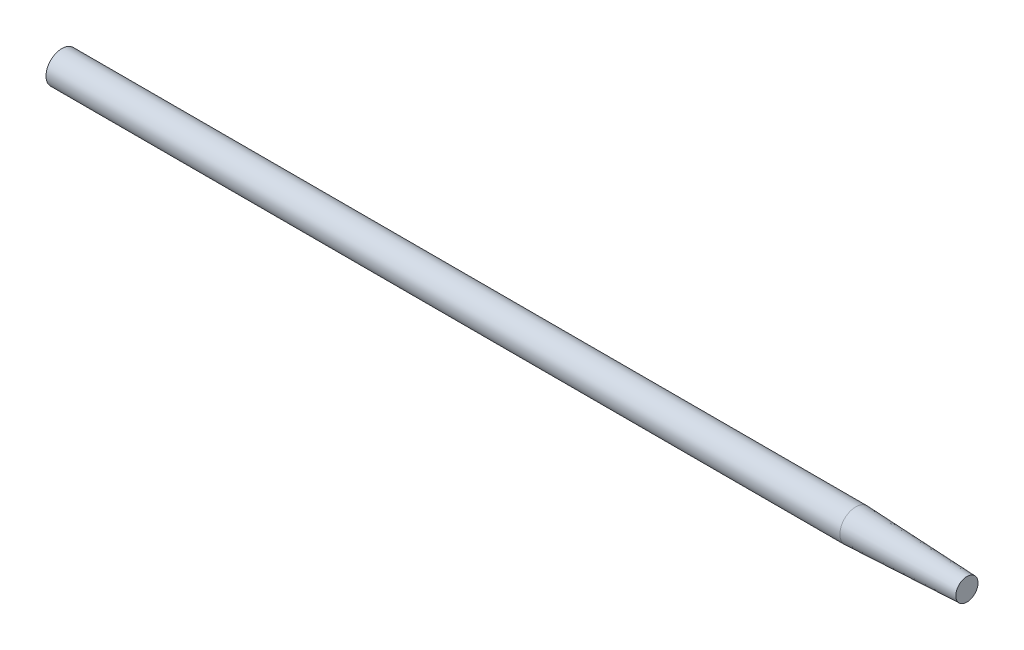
ISO-10303-21;
HEADER;
FILE_DESCRIPTION(('STEP AP214'),'2;1');
FILE_NAME('part.step','',(''),(''),'','','');
FILE_SCHEMA(('AUTOMOTIVE_DESIGN { 1 0 10303 214 1 1 1 1 }'));
ENDSEC;
DATA;
#1=APPLICATION_CONTEXT('core data for automotive mechanical design processes');
#2=APPLICATION_PROTOCOL_DEFINITION('international standard','automotive_design',2000,#1);
#3=PRODUCT_CONTEXT('',#1,'mechanical');
#4=PRODUCT('Part','Part','',(#3));
#5=PRODUCT_RELATED_PRODUCT_CATEGORY('part','',(#4));
#6=PRODUCT_DEFINITION_FORMATION('','',#4);
#7=PRODUCT_DEFINITION_CONTEXT('part definition',#1,'design');
#8=PRODUCT_DEFINITION('design','',#6,#7);
#9=PRODUCT_DEFINITION_SHAPE('','',#8);
#10=(LENGTH_UNIT() NAMED_UNIT(*) SI_UNIT(.MILLI.,.METRE.));
#11=(NAMED_UNIT(*) PLANE_ANGLE_UNIT() SI_UNIT($,.RADIAN.));
#12=(NAMED_UNIT(*) SI_UNIT($,.STERADIAN.) SOLID_ANGLE_UNIT());
#13=UNCERTAINTY_MEASURE_WITH_UNIT(LENGTH_MEASURE(1.E-05),#10,'distance_accuracy_value','');
#14=(GEOMETRIC_REPRESENTATION_CONTEXT(3) GLOBAL_UNCERTAINTY_ASSIGNED_CONTEXT((#13)) GLOBAL_UNIT_ASSIGNED_CONTEXT((#10,
#11,#12)) REPRESENTATION_CONTEXT('',''));
#15=CARTESIAN_POINT('',(0.,0.,0.));
#16=DIRECTION('',(0.,0.,1.));
#17=DIRECTION('',(1.,0.,0.));
#18=AXIS2_PLACEMENT_3D('',#15,#16,#17);
#19=CARTESIAN_POINT('',(0.,0.,0.));
#20=DIRECTION('',(1.,0.,0.));
#21=DIRECTION('',(0.,0.,-1.));
#22=AXIS2_PLACEMENT_3D('',#19,#20,#21);
#23=PLANE('',#22);
#24=CARTESIAN_POINT('',(0.,0.,0.));
#25=DIRECTION('',(-1.,0.,0.));
#26=DIRECTION('',(0.,0.,1.));
#27=AXIS2_PLACEMENT_3D('',#24,#25,#26);
#28=CIRCLE('',#27,10.);
#29=CARTESIAN_POINT('',(0.,0.,10.));
#30=VERTEX_POINT('',#29);
#31=EDGE_CURVE('E44',#30,#30,#28,.T.);
#32=ORIENTED_EDGE('',*,*,#31,.T.);
#33=EDGE_LOOP('',(#32));
#34=FACE_BOUND('',#33,.T.);
#35=ADVANCED_FACE('F33',(#34),#23,.F.);
#36=CARTESIAN_POINT('',(0.,0.,0.));
#37=DIRECTION('',(-1.,0.,0.));
#38=DIRECTION('',(0.,0.,1.));
#39=AXIS2_PLACEMENT_3D('',#36,#37,#38);
#40=CYLINDRICAL_SURFACE('',#39,10.);
#41=CARTESIAN_POINT('',(500.000000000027,0.,0.));
#42=DIRECTION('',(-1.,0.,0.));
#43=DIRECTION('',(0.,0.,1.));
#44=AXIS2_PLACEMENT_3D('',#41,#42,#43);
#45=CIRCLE('',#44,10.);
#46=CARTESIAN_POINT('',(500.000000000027,0.,10.));
#47=VERTEX_POINT('',#46);
#48=EDGE_CURVE('E40',#47,#47,#45,.T.);
#49=ORIENTED_EDGE('',*,*,#48,.T.);
#50=EDGE_LOOP('',(#49));
#51=FACE_BOUND('',#50,.T.);
#52=ORIENTED_EDGE('',*,*,#31,.F.);
#53=EDGE_LOOP('',(#52));
#54=FACE_BOUND('',#53,.T.);
#55=ADVANCED_FACE('F52',(#51,#54),#40,.T.);
#56=CARTESIAN_POINT('',(570.,0.,0.));
#57=DIRECTION('',(-1.,0.,0.));
#58=DIRECTION('',(0.,0.,1.));
#59=AXIS2_PLACEMENT_3D('',#56,#57,#58);
#60=PLANE('',#59);
#61=CARTESIAN_POINT('',(570.,0.,0.));
#62=DIRECTION('',(-1.,0.,0.));
#63=DIRECTION('',(0.,0.,1.));
#64=AXIS2_PLACEMENT_3D('',#61,#62,#63);
#65=CIRCLE('',#64,7.0000000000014);
#66=CARTESIAN_POINT('',(570.,0.,7.0000000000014));
#67=VERTEX_POINT('',#66);
#68=EDGE_CURVE('E10',#67,#67,#65,.F.);
#69=ORIENTED_EDGE('',*,*,#68,.T.);
#70=EDGE_LOOP('',(#69));
#71=FACE_BOUND('',#70,.T.);
#72=ADVANCED_FACE('F54',(#71),#60,.F.);
#73=CARTESIAN_POINT('',(500.000000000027,0.,0.));
#74=DIRECTION('',(-1.,0.,0.));
#75=DIRECTION('',(0.,0.,1.));
#76=AXIS2_PLACEMENT_3D('',#73,#74,#75);
#77=CONICAL_SURFACE('',#76,10.,0.0428309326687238);
#78=ORIENTED_EDGE('',*,*,#68,.F.);
#79=EDGE_LOOP('',(#78));
#80=FACE_BOUND('',#79,.T.);
#81=ORIENTED_EDGE('',*,*,#48,.F.);
#82=EDGE_LOOP('',(#81));
#83=FACE_BOUND('',#82,.T.);
#84=ADVANCED_FACE('F35',(#80,#83),#77,.T.);
#85=CLOSED_SHELL('',(#35,#55,#72,#84));
#86=MANIFOLD_SOLID_BREP('B2',#85);
#87=ADVANCED_BREP_SHAPE_REPRESENTATION('',(#18,#86),#14);
#88=SHAPE_DEFINITION_REPRESENTATION(#9,#87);
ENDSEC;
END-ISO-10303-21;
